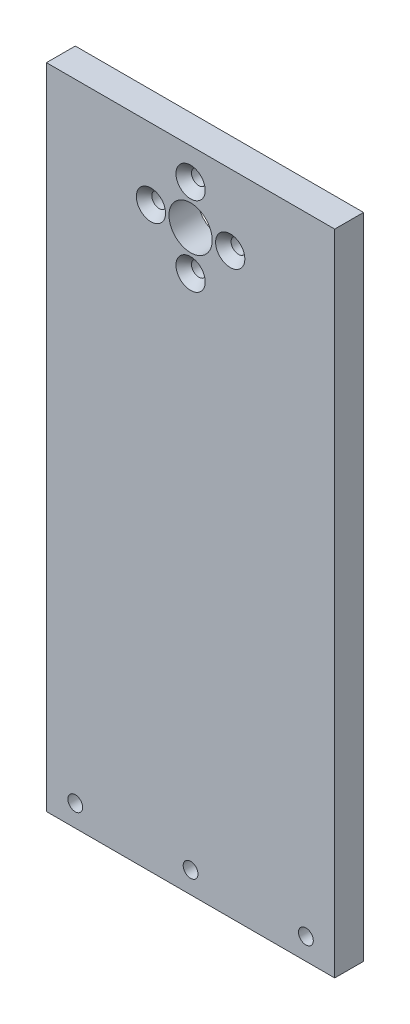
from build123d import *

# Parameters (mm, degrees)
SKETCH1_W                                        = 127
SKETCH1_H                                        = 285.75
BOSS_EXTRUDE1_DEPTH                              = 12.7
F_3_4_0_75_DIAMETER_HOLE1_D                      = 19.05
CSK_FOR_1_4_FLAT_HEAD_MACHINE_SCREW1_D           = 6.5278
CSK_FOR_1_4_FLAT_HEAD_MACHINE_SCREW1_CSINK_D     = 12.8778
CSK_FOR_1_4_FLAT_HEAD_MACHINE_SCREW1_CSINK_ANGLE = 82
CBORE_FOR_1_4_SOCKET_HEAD_CAP_SCREW1_D           = 6.5278
CBORE_FOR_1_4_SOCKET_HEAD_CAP_SCREW1_CBORE_D     = 11.1125
CBORE_FOR_1_4_SOCKET_HEAD_CAP_SCREW1_CBORE_DEPTH = 6.35


with BuildPart() as part:
    # Sketch1 → Boss-Extrude1 (new body)
    with BuildSketch(Plane.XY):
        with Locations((0, -111.633)):
            Rectangle(SKETCH1_W, SKETCH1_H)
    extrude(amount=BOSS_EXTRUDE1_DEPTH)

    # 3_4 _0.75_ Diameter Hole1 (through all)
    with Locations(Plane.XY.offset(12.7)):
        with Locations((0, 0)):
            Hole(F_3_4_0_75_DIAMETER_HOLE1_D / 2)

    # CSK for 1_4 Flat Head Machine Screw1 (through all)
    with Locations(Plane.XY.offset(12.7)):
        with Locations((-17.4625, 0), (0, 17.4625), (17.4625, 0), (0, -17.4625)):
            CounterSinkHole(CSK_FOR_1_4_FLAT_HEAD_MACHINE_SCREW1_D / 2, CSK_FOR_1_4_FLAT_HEAD_MACHINE_SCREW1_CSINK_D / 2, counter_sink_angle=CSK_FOR_1_4_FLAT_HEAD_MACHINE_SCREW1_CSINK_ANGLE)

    # CBORE for 1_4 Socket Head Cap Screw1 (through all)
    with Locations(Plane(origin=(14.791610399, 136.526270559, 0), x_dir=(1, 0, 0), z_dir=(0, 0, -1))):
        with Locations((-65.591610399, 381.509270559), (-14.791610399, 381.509270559), (36.008389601, 381.509270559)):
            CounterBoreHole(CBORE_FOR_1_4_SOCKET_HEAD_CAP_SCREW1_D / 2, CBORE_FOR_1_4_SOCKET_HEAD_CAP_SCREW1_CBORE_D / 2, CBORE_FOR_1_4_SOCKET_HEAD_CAP_SCREW1_CBORE_DEPTH)


solid = part.part
